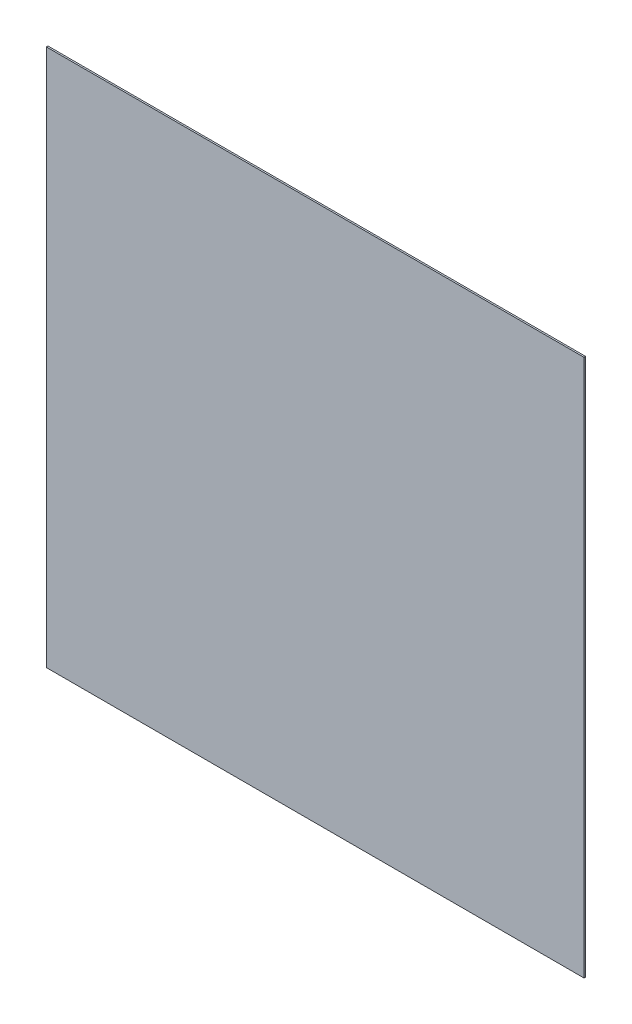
from build123d import *

# Parameters (mm, degrees)
ESQUISSE1_W        = 1000
ESQUISSE1_H        = 1000
BOSS_EXTRU_1_DEPTH = 3


with BuildPart() as part:
    # Esquisse1 → Boss.-Extru.1 (new body)
    with BuildSketch(Plane.XY):
        with Locations((500, 500)):
            Rectangle(ESQUISSE1_W, ESQUISSE1_H)
    extrude(amount=BOSS_EXTRU_1_DEPTH)


solid = part.part
